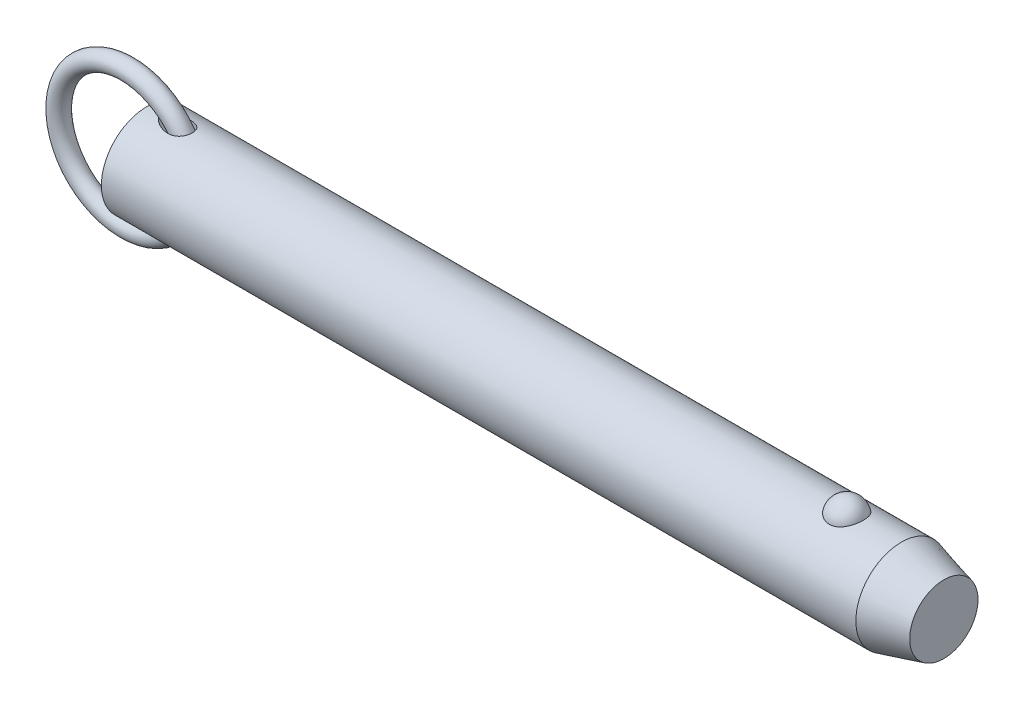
ISO-10303-21;
HEADER;
FILE_DESCRIPTION(('STEP AP214'),'2;1');
FILE_NAME('part.step','',(''),(''),'','','');
FILE_SCHEMA(('AUTOMOTIVE_DESIGN { 1 0 10303 214 1 1 1 1 }'));
ENDSEC;
DATA;
#1=APPLICATION_CONTEXT('core data for automotive mechanical design processes');
#2=APPLICATION_PROTOCOL_DEFINITION('international standard','automotive_design',2000,#1);
#3=PRODUCT_CONTEXT('',#1,'mechanical');
#4=PRODUCT('Part','Part','',(#3));
#5=PRODUCT_RELATED_PRODUCT_CATEGORY('part','',(#4));
#6=PRODUCT_DEFINITION_FORMATION('','',#4);
#7=PRODUCT_DEFINITION_CONTEXT('part definition',#1,'design');
#8=PRODUCT_DEFINITION('design','',#6,#7);
#9=PRODUCT_DEFINITION_SHAPE('','',#8);
#10=(LENGTH_UNIT() NAMED_UNIT(*) SI_UNIT(.MILLI.,.METRE.));
#11=(NAMED_UNIT(*) PLANE_ANGLE_UNIT() SI_UNIT($,.RADIAN.));
#12=(NAMED_UNIT(*) SI_UNIT($,.STERADIAN.) SOLID_ANGLE_UNIT());
#13=UNCERTAINTY_MEASURE_WITH_UNIT(LENGTH_MEASURE(1.E-05),#10,'distance_accuracy_value','');
#14=(GEOMETRIC_REPRESENTATION_CONTEXT(3) GLOBAL_UNCERTAINTY_ASSIGNED_CONTEXT((#13)) GLOBAL_UNIT_ASSIGNED_CONTEXT((#10,
#11,#12)) REPRESENTATION_CONTEXT('',''));
#15=CARTESIAN_POINT('',(0.,0.,0.));
#16=DIRECTION('',(0.,0.,1.));
#17=DIRECTION('',(1.,0.,0.));
#18=AXIS2_PLACEMENT_3D('',#15,#16,#17);
#19=CARTESIAN_POINT('',(-5.53898640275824,0.,0.));
#20=DIRECTION('',(0.,0.,1.));
#21=DIRECTION('',(1.,0.,0.));
#22=AXIS2_PLACEMENT_3D('',#19,#20,#21);
#23=TOROIDAL_SURFACE('',#22,19.05,2.54);
#24=CARTESIAN_POINT('',(16.0510135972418,0.,0.));
#25=VERTEX_POINT('',#24);
#26=VERTEX_LOOP('',#25);
#27=FACE_BOUND('',#26,.T.);
#28=ADVANCED_FACE('P0_F12',(#27),#23,.T.);
#29=CLOSED_SHELL('',(#28));
#30=MANIFOLD_SOLID_BREP('P0_B1',#29);
#31=CARTESIAN_POINT('',(0.,0.,0.));
#32=DIRECTION('',(1.,0.,0.));
#33=DIRECTION('',(0.,0.,-1.));
#34=AXIS2_PLACEMENT_3D('',#31,#32,#33);
#35=CYLINDRICAL_SURFACE('',#34,12.7);
#36=CARTESIAN_POINT('',(210.400738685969,0.,0.));
#37=DIRECTION('',(1.,0.,0.));
#38=DIRECTION('',(0.,0.,-1.));
#39=AXIS2_PLACEMENT_3D('',#36,#37,#38);
#40=CIRCLE('',#39,12.7);
#41=CARTESIAN_POINT('',(210.400738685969,0.,-12.7));
#42=VERTEX_POINT('',#41);
#43=EDGE_CURVE('P1_E89',#42,#42,#40,.T.);
#44=ORIENTED_EDGE('',*,*,#43,.F.);
#45=EDGE_LOOP('',(#44));
#46=FACE_BOUND('',#45,.T.);
#47=CARTESIAN_POINT('',(0.,0.,0.));
#48=DIRECTION('',(1.,0.,0.));
#49=DIRECTION('',(0.,0.,-1.));
#50=AXIS2_PLACEMENT_3D('',#47,#48,#49);
#51=CIRCLE('',#50,12.7);
#52=CARTESIAN_POINT('',(0.,0.,-12.7));
#53=VERTEX_POINT('',#52);
#54=EDGE_CURVE('P1_E52',#53,#53,#51,.T.);
#55=ORIENTED_EDGE('',*,*,#54,.T.);
#56=EDGE_LOOP('',(#55));
#57=FACE_BOUND('',#56,.T.);
#58=CARTESIAN_POINT('',(195.160042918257,11.7500437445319,4.81938502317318));
#59=CARTESIAN_POINT('',(195.035088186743,11.7500430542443,4.81938571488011));
#60=CARTESIAN_POINT('',(194.910144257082,11.7520975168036,4.81438658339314));
#61=CARTESIAN_POINT('',(194.661142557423,11.760253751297,4.79442904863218));
#62=CARTESIAN_POINT('',(194.537085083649,11.7663568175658,4.77946746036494));
#63=CARTESIAN_POINT('',(194.290901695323,11.7824262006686,4.7397141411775));
#64=CARTESIAN_POINT('',(194.168774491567,11.7923898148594,4.71492928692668));
#65=CARTESIAN_POINT('',(193.927187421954,11.8158938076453,4.65571340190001));
#66=CARTESIAN_POINT('',(193.80772859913,11.8294355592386,4.6212786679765));
#67=CARTESIAN_POINT('',(193.572557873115,11.8596812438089,4.54309502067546));
#68=CARTESIAN_POINT('',(193.456839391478,11.8763792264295,4.49936361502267));
#69=CARTESIAN_POINT('',(193.229653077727,11.9124878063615,4.40287235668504));
#70=CARTESIAN_POINT('',(193.118186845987,11.9318994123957,4.35010914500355));
#71=CARTESIAN_POINT('',(192.791278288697,11.9934256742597,4.17881316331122));
#72=CARTESIAN_POINT('',(192.583127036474,12.038858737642,4.04720756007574));
#73=CARTESIAN_POINT('',(192.185850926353,12.1352173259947,3.748564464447));
#74=CARTESIAN_POINT('',(191.997443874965,12.1862630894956,3.58061821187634));
#75=CARTESIAN_POINT('',(191.650521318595,12.2875163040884,3.21600758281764));
#76=CARTESIAN_POINT('',(191.492011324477,12.3377235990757,3.0193379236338));
#77=CARTESIAN_POINT('',(191.20168878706,12.4344923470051,2.592916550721));
#78=CARTESIAN_POINT('',(191.071376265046,12.4807925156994,2.36208286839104));
#79=CARTESIAN_POINT('',(190.849407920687,12.5623454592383,1.88070399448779));
#80=CARTESIAN_POINT('',(190.757755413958,12.5975972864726,1.63015711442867));
#81=CARTESIAN_POINT('',(190.614046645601,12.6538414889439,1.1129886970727));
#82=CARTESIAN_POINT('',(190.562499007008,12.6746503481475,0.846205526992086));
#83=CARTESIAN_POINT('',(190.501977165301,12.699153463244,0.307085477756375));
#84=CARTESIAN_POINT('',(190.493001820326,12.7028481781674,0.0347487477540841));
#85=CARTESIAN_POINT('',(190.517731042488,12.6927785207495,-0.506073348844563));
#86=CARTESIAN_POINT('',(190.551189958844,12.6791146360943,-0.774571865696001));
#87=CARTESIAN_POINT('',(190.659687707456,12.635882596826,-1.30170246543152));
#88=CARTESIAN_POINT('',(190.73472729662,12.606314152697,-1.56033436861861));
#89=CARTESIAN_POINT('',(190.92500006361,12.5342328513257,-2.0608389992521));
#90=CARTESIAN_POINT('',(191.040287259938,12.4917026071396,-2.30268867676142));
#91=CARTESIAN_POINT('',(191.308704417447,12.3981123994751,-2.76259600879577));
#92=CARTESIAN_POINT('',(191.461837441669,12.3470517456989,-2.98065173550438));
#93=CARTESIAN_POINT('',(191.803507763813,12.2416045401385,-3.38786328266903));
#94=CARTESIAN_POINT('',(191.992201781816,12.1872040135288,-3.57688418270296));
#95=CARTESIAN_POINT('',(192.400239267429,12.0814086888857,-3.91941073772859));
#96=CARTESIAN_POINT('',(192.619580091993,12.0300136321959,-4.07291945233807));
#97=CARTESIAN_POINT('',(193.078375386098,11.9373542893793,-4.33691289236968));
#98=CARTESIAN_POINT('',(193.317304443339,11.8958982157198,-4.44824125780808));
#99=CARTESIAN_POINT('',(193.81243761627,11.8268116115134,-4.62881985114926));
#100=CARTESIAN_POINT('',(194.068635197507,11.7991758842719,-4.69808589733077));
#101=CARTESIAN_POINT('',(194.577164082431,11.7622209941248,-4.78983181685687));
#102=CARTESIAN_POINT('',(194.829041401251,11.7520502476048,-4.81449025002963));
#103=CARTESIAN_POINT('',(195.333573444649,11.7485796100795,-4.82295735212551));
#104=CARTESIAN_POINT('',(195.586228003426,11.7552763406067,-4.80677420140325));
#105=CARTESIAN_POINT('',(196.076834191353,11.7842584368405,-4.73525430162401));
#106=CARTESIAN_POINT('',(196.314998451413,11.8060486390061,-4.68116061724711));
#107=CARTESIAN_POINT('',(196.778489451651,11.8622750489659,-4.53678133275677));
#108=CARTESIAN_POINT('',(197.003815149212,11.8967122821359,-4.44649279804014));
#109=CARTESIAN_POINT('',(197.440801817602,11.9754603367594,-4.2298761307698));
#110=CARTESIAN_POINT('',(197.652057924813,12.0199699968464,-4.10280539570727));
#111=CARTESIAN_POINT('',(198.050601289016,12.1138028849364,-3.81685409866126));
#112=CARTESIAN_POINT('',(198.237883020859,12.163127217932,-3.65796622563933));
#113=CARTESIAN_POINT('',(198.593350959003,12.2642343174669,-3.30364864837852));
#114=CARTESIAN_POINT('',(198.760111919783,12.3160165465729,-3.10678783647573));
#115=CARTESIAN_POINT('',(199.059579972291,12.4142566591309,-2.68748409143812));
#116=CARTESIAN_POINT('',(199.192280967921,12.4607135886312,-2.4650365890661));
#117=CARTESIAN_POINT('',(199.424691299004,12.5450236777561,-1.9928951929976));
#118=CARTESIAN_POINT('',(199.523215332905,12.5825557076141,-1.74255918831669));
#119=CARTESIAN_POINT('',(199.679227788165,12.6431720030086,-1.2277373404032));
#120=CARTESIAN_POINT('',(199.736715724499,12.6662560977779,-0.96325132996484));
#121=CARTESIAN_POINT('',(199.809544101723,12.6956486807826,-0.4273550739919));
#122=CARTESIAN_POINT('',(199.824837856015,12.7019385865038,-0.155937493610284));
#123=CARTESIAN_POINT('',(199.812779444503,12.6970201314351,0.385928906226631));
#124=CARTESIAN_POINT('',(199.78542805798,12.6858120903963,0.656377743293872));
#125=CARTESIAN_POINT('',(199.713060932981,12.6568455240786,1.05454017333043));
#126=CARTESIAN_POINT('',(199.683796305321,12.6451962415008,1.185778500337));
#127=CARTESIAN_POINT('',(199.615022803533,12.6181819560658,1.44513808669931));
#128=CARTESIAN_POINT('',(199.575517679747,12.6028183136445,1.57326046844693));
#129=CARTESIAN_POINT('',(199.486439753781,12.5687547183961,1.82554978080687));
#130=CARTESIAN_POINT('',(199.436862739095,12.5500533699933,1.9497150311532));
#131=CARTESIAN_POINT('',(199.32792115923,12.5098093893,2.19314370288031));
#132=CARTESIAN_POINT('',(199.268560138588,12.4882677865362,2.31240887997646));
#133=CARTESIAN_POINT('',(199.13997128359,12.4427679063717,2.5459303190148));
#134=CARTESIAN_POINT('',(199.070688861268,12.4187964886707,2.66015396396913));
#135=CARTESIAN_POINT('',(198.922903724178,12.3691892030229,2.88202659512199));
#136=CARTESIAN_POINT('',(198.844404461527,12.3435539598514,2.98967802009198));
#137=CARTESIAN_POINT('',(198.678550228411,12.2912955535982,3.1977438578));
#138=CARTESIAN_POINT('',(198.591191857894,12.2646720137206,3.29815546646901));
#139=CARTESIAN_POINT('',(198.408161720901,12.2111945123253,3.49095035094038));
#140=CARTESIAN_POINT('',(198.312493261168,12.1843406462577,3.58333679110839));
#141=CARTESIAN_POINT('',(198.113627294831,12.1312249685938,3.75922876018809));
#142=CARTESIAN_POINT('',(198.010450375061,12.104961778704,3.84275713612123));
#143=CARTESIAN_POINT('',(197.79701336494,12.0537284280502,4.00056406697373));
#144=CARTESIAN_POINT('',(197.686756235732,12.028757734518,4.07484645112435));
#145=CARTESIAN_POINT('',(197.459755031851,11.9808306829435,4.21367959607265));
#146=CARTESIAN_POINT('',(197.343006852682,11.9578756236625,4.27822410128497));
#147=CARTESIAN_POINT('',(197.10394258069,11.9147184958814,4.39698483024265));
#148=CARTESIAN_POINT('',(196.981628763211,11.894515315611,4.45120522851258));
#149=CARTESIAN_POINT('',(196.722952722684,11.8561129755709,4.55255353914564));
#150=CARTESIAN_POINT('',(196.586223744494,11.8381764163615,4.59884858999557));
#151=CARTESIAN_POINT('',(196.308608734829,11.8069093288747,4.67853897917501));
#152=CARTESIAN_POINT('',(196.167724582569,11.7935767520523,4.71194005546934));
#153=CARTESIAN_POINT('',(195.88309446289,11.7720277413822,4.76552188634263));
#154=CARTESIAN_POINT('',(195.739348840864,11.7638106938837,4.78570422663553));
#155=CARTESIAN_POINT('',(195.450411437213,11.7528195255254,4.81263433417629));
#156=CARTESIAN_POINT('',(195.305219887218,11.7500445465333,4.81938421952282));
#157=CARTESIAN_POINT('',(195.160042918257,11.7500437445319,4.81938502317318));
#158=B_SPLINE_CURVE_WITH_KNOTS('',3,(#58,#59,#60,#61,#62,#63,#64,#65,#66,#67,#68,#69,#70,#71,
#72,#73,#74,#75,#76,#77,#78,#79,#80,#81,#82,#83,#84,#85,#86,#87,#88,#89,#90,#91,#92,#93,#94,#95,
#96,#97,#98,#99,#100,#101,#102,#103,#104,#105,#106,#107,#108,#109,#110,#111,#112,#113,#114,#115,
#116,#117,#118,#119,#120,#121,#122,#123,#124,#125,#126,#127,#128,#129,#130,#131,#132,#133,#134,
#135,#136,#137,#138,#139,#140,#141,#142,#143,#144,#145,#146,#147,#148,#149,#150,#151,#152,#153,
#154,#155,#156,#157),.UNSPECIFIED.,.T.,.F.,(4,2,2,2,2,2,2,2,2,2,2,2,2,2,2,2,2,2,2,2,2,2,2,2,2,2,
2,2,2,2,2,2,2,2,2,2,2,2,2,2,2,2,2,2,2,2,2,2,2,4),(0.,0.374729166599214,0.749578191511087,
1.12416526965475,1.49889629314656,1.87292776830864,2.24709865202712,2.99481328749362,
3.76399449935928,4.53331735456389,5.3368391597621,6.14042986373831,6.95405296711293,
7.76765424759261,8.57656703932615,9.38549455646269,10.1955119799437,11.0055949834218,
11.8193353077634,12.6330054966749,13.4294141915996,14.2255231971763,14.9815786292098,
15.7374826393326,16.4696948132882,17.2019663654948,17.9501979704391,18.6986017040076,
19.4844704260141,20.2704797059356,21.0815215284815,21.8925729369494,22.7045213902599,
23.5164550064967,23.9209608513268,24.3253187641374,24.7298461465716,25.1342272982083,
25.54092555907,25.9474719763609,26.3541750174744,26.7607169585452,27.1661834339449,
27.5714814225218,27.9770386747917,28.3824315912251,28.818120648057,29.2536155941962,
29.6890582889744,30.1244323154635),.UNSPECIFIED.);
#159=CARTESIAN_POINT('',(195.160042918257,11.7500437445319,4.81938502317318));
#160=VERTEX_POINT('',#159);
#161=EDGE_CURVE('P1_E80',#160,#160,#158,.T.);
#162=ORIENTED_EDGE('',*,*,#161,.T.);
#163=EDGE_LOOP('',(#162));
#164=FACE_BOUND('',#163,.T.);
#165=CARTESIAN_POINT('',(-5.53898640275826,0.,0.));
#166=DIRECTION('',(0.796400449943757,-0.604769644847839,0.));
#167=DIRECTION('',(0.604769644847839,0.796400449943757,0.));
#168=AXIS2_PLACEMENT_3D('',#165,#166,#167);
#169=ELLIPSE('',#168,15.9467514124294,12.7);
#170=CARTESIAN_POINT('',(4.09482149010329,12.6864319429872,0.586893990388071));
#171=VERTEX_POINT('',#170);
#172=CARTESIAN_POINT('',(4.09482149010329,12.6864319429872,-0.586893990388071));
#173=VERTEX_POINT('',#172);
#174=EDGE_CURVE('P1_E47',#171,#173,#169,.F.);
#175=ORIENTED_EDGE('',*,*,#174,.T.);
#176=CARTESIAN_POINT('',(4.06153170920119,12.6905758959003,-0.48916605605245));
#177=CARTESIAN_POINT('',(4.0811137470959,12.6881366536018,-0.552489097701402));
#178=CARTESIAN_POINT('',(4.1041785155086,12.6852663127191,-0.614604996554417));
#179=CARTESIAN_POINT('',(4.15628434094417,12.6787965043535,-0.736067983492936));
#180=CARTESIAN_POINT('',(4.18531032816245,12.6751988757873,-0.795421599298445));
#181=CARTESIAN_POINT('',(4.27911159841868,12.6636052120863,-0.967590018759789));
#182=CARTESIAN_POINT('',(4.35123408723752,12.654730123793,-1.07635920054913));
#183=CARTESIAN_POINT('',(4.49106800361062,12.6376715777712,-1.25922957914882));
#184=CARTESIAN_POINT('',(4.55601066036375,12.6297947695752,-1.33556751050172));
#185=CARTESIAN_POINT('',(4.692236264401,12.6134116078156,-1.4823274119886));
#186=CARTESIAN_POINT('',(4.76352147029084,12.6049050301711,-1.55274725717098));
#187=CARTESIAN_POINT('',(4.91163946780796,12.587417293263,-1.68868704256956));
#188=CARTESIAN_POINT('',(4.98851399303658,12.5784327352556,-1.75416062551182));
#189=CARTESIAN_POINT('',(5.14630057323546,12.560235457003,-1.88003275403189));
#190=CARTESIAN_POINT('',(5.22721398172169,12.5510226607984,-1.94042957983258));
#191=CARTESIAN_POINT('',(5.45368877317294,12.5256514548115,-2.09966332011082));
#192=CARTESIAN_POINT('',(5.60261616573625,12.5094182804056,-2.19371988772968));
#193=CARTESIAN_POINT('',(5.90795545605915,12.4774211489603,-2.36893890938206));
#194=CARTESIAN_POINT('',(6.0643723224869,12.4616575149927,-2.45009264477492));
#195=CARTESIAN_POINT('',(6.38306132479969,12.431227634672,-2.6000824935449));
#196=CARTESIAN_POINT('',(6.54533237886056,12.4165611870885,-2.66892086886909));
#197=CARTESIAN_POINT('',(6.87462618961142,12.3889351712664,-2.79435199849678));
#198=CARTESIAN_POINT('',(7.04164773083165,12.3759751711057,-2.85094785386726));
#199=CARTESIAN_POINT('',(7.38726647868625,12.3518460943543,-2.95377962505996));
#200=CARTESIAN_POINT('',(7.56604577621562,12.3407843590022,-2.99943209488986));
#201=CARTESIAN_POINT('',(7.92698692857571,12.3219309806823,-3.07596683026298));
#202=CARTESIAN_POINT('',(8.10914972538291,12.314140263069,-3.10684491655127));
#203=CARTESIAN_POINT('',(8.47511457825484,12.3025918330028,-3.15226850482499));
#204=CARTESIAN_POINT('',(8.6589097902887,12.2988216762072,-3.16686440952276));
#205=CARTESIAN_POINT('',(9.02696087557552,12.2959421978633,-3.17802250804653));
#206=CARTESIAN_POINT('',(9.21121628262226,12.2968292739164,-3.17459864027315));
#207=CARTESIAN_POINT('',(9.61636263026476,12.3045198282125,-3.14471110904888));
#208=CARTESIAN_POINT('',(9.83695552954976,12.3125080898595,-3.11363232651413));
#209=CARTESIAN_POINT('',(10.1619126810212,12.3303028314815,-3.04206574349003));
#210=CARTESIAN_POINT('',(10.2692747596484,12.3372061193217,-3.01403983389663));
#211=CARTESIAN_POINT('',(10.4811758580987,12.3528538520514,-2.94925947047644));
#212=CARTESIAN_POINT('',(10.5857162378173,12.361597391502,-2.91250930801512));
#213=CARTESIAN_POINT('',(10.792132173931,12.3808585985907,-2.8295174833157));
#214=CARTESIAN_POINT('',(10.8939665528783,12.3913944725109,-2.78317723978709));
#215=CARTESIAN_POINT('',(11.092611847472,12.4138762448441,-2.68112002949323));
#216=CARTESIAN_POINT('',(11.1894254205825,12.4258213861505,-2.62540809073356));
#217=CARTESIAN_POINT('',(11.3768740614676,12.4507225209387,-2.50465655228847));
#218=CARTESIAN_POINT('',(11.4675115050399,12.4636781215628,-2.43962056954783));
#219=CARTESIAN_POINT('',(11.6414572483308,12.4901070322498,-2.30048560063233));
#220=CARTESIAN_POINT('',(11.7247669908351,12.5035802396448,-2.22638840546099));
#221=CARTESIAN_POINT('',(11.8713131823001,12.5285000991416,-2.08117367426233));
#222=CARTESIAN_POINT('',(11.9357009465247,12.5399538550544,-2.01121596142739));
#223=CARTESIAN_POINT('',(12.0576805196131,12.5624496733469,-1.86555293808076));
#224=CARTESIAN_POINT('',(12.1152732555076,12.5734917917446,-1.7898484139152));
#225=CARTESIAN_POINT('',(12.223073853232,12.5947858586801,-1.63327883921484));
#226=CARTESIAN_POINT('',(12.2732844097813,12.6050380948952,-1.5524156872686));
#227=CARTESIAN_POINT('',(12.3658430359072,12.6243983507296,-1.38621267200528));
#228=CARTESIAN_POINT('',(12.408191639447,12.6335064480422,-1.30087311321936));
#229=CARTESIAN_POINT('',(12.5150098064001,12.6569076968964,-1.05702619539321));
#230=CARTESIAN_POINT('',(12.5703399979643,12.6695746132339,-0.894232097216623));
#231=CARTESIAN_POINT('',(12.6526225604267,12.6886816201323,-0.561391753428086));
#232=CARTESIAN_POINT('',(12.6795825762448,12.6951233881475,-0.391347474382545));
#233=CARTESIAN_POINT('',(12.7041016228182,12.7009766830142,-0.0537636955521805));
#234=CARTESIAN_POINT('',(12.7024538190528,12.7005778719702,0.113714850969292));
#235=CARTESIAN_POINT('',(12.6717240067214,12.6932548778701,0.445979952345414));
#236=CARTESIAN_POINT('',(12.6426435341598,12.6863310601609,0.610766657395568));
#237=CARTESIAN_POINT('',(12.5579769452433,12.6667465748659,0.932429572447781));
#238=CARTESIAN_POINT('',(12.5024793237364,12.6541050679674,1.08933027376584));
#239=CARTESIAN_POINT('',(12.3665691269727,12.6244558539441,1.39146752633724));
#240=CARTESIAN_POINT('',(12.2861577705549,12.6074483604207,1.53670464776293));
#241=CARTESIAN_POINT('',(12.1018203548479,12.5706804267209,1.81319588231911));
#242=CARTESIAN_POINT('',(11.9976588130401,12.5508932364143,1.94428915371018));
#243=CARTESIAN_POINT('',(11.7695265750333,12.5107540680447,2.18776051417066));
#244=CARTESIAN_POINT('',(11.6455540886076,12.4904020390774,2.3001369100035));
#245=CARTESIAN_POINT('',(11.3759347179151,12.4502278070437,2.50870972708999));
#246=CARTESIAN_POINT('',(11.2295880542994,12.4304654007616,2.60400962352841));
#247=CARTESIAN_POINT('',(10.9239803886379,12.3941696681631,2.77162929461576));
#248=CARTESIAN_POINT('',(10.7647152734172,12.3776373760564,2.84394171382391));
#249=CARTESIAN_POINT('',(10.4192039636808,12.3473062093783,2.97303525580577));
#250=CARTESIAN_POINT('',(10.2319332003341,12.3340204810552,3.027171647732));
#251=CARTESIAN_POINT('',(9.85152982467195,12.3134301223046,3.10986173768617));
#252=CARTESIAN_POINT('',(9.65839336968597,12.3061295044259,3.13839827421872));
#253=CARTESIAN_POINT('',(9.31022514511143,12.2982822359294,3.16897517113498));
#254=CARTESIAN_POINT('',(9.15555718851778,12.2966525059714,3.17526894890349));
#255=CARTESIAN_POINT('',(8.84618945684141,12.2967963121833,3.17471335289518));
#256=CARTESIAN_POINT('',(8.6914897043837,12.2985715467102,3.16785742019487));
#257=CARTESIAN_POINT('',(8.38280471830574,12.3051648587,3.14214692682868));
#258=CARTESIAN_POINT('',(8.22882218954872,12.3099904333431,3.12326280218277));
#259=CARTESIAN_POINT('',(7.92276070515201,12.3222644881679,3.07448013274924));
#260=CARTESIAN_POINT('',(7.77068148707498,12.3297126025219,3.04458312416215));
#261=CARTESIAN_POINT('',(7.46452663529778,12.3470493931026,2.97350781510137));
#262=CARTESIAN_POINT('',(7.31052714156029,12.3570043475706,2.93201910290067));
#263=CARTESIAN_POINT('',(7.00579083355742,12.3787609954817,2.83876185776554));
#264=CARTESIAN_POINT('',(6.85505451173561,12.3905629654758,2.7869917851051));
#265=CARTESIAN_POINT('',(6.55781208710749,12.415528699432,2.67357744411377));
#266=CARTESIAN_POINT('',(6.41129783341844,12.4286895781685,2.61195394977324));
#267=CARTESIAN_POINT('',(6.12302950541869,12.4559398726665,2.47874512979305));
#268=CARTESIAN_POINT('',(5.98127390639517,12.4700289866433,2.40716303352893));
#269=CARTESIAN_POINT('',(5.67073126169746,12.5020754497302,2.23550426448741));
#270=CARTESIAN_POINT('',(5.50343839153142,12.5201625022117,2.13268685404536));
#271=CARTESIAN_POINT('',(5.26147616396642,12.5471537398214,1.96522579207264));
#272=CARTESIAN_POINT('',(5.18224299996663,12.5561365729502,1.90713440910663));
#273=CARTESIAN_POINT('',(5.0274647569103,12.5739122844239,1.78618989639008));
#274=CARTESIAN_POINT('',(4.95191912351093,12.5827051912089,1.72333748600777));
#275=CARTESIAN_POINT('',(4.81787163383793,12.598469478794,1.60360864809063));
#276=CARTESIAN_POINT('',(4.75865966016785,12.6054958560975,1.54753994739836));
#277=CARTESIAN_POINT('',(4.64406285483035,12.6191906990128,1.43158546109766));
#278=CARTESIAN_POINT('',(4.58867926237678,12.6258590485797,1.37169845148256));
#279=CARTESIAN_POINT('',(4.43014912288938,12.6450546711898,1.18656670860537));
#280=CARTESIAN_POINT('',(4.33372726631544,12.6568788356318,1.05507993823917));
#281=CARTESIAN_POINT('',(4.21252055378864,12.6718304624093,0.848052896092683));
#282=CARTESIAN_POINT('',(4.17660155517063,12.6762773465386,0.779100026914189));
#283=CARTESIAN_POINT('',(4.11264979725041,12.6842122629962,0.637080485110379));
#284=CARTESIAN_POINT('',(4.08466792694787,12.6876941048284,0.563990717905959));
#285=CARTESIAN_POINT('',(4.06153170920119,12.6905758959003,0.489166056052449));
#286=B_SPLINE_CURVE_WITH_KNOTS('',3,(#176,#177,#178,#179,#180,#181,#182,#183,#184,#185,#186,
#187,#188,#189,#190,#191,#192,#193,#194,#195,#196,#197,#198,#199,#200,#201,#202,#203,#204,#205,
#206,#207,#208,#209,#210,#211,#212,#213,#214,#215,#216,#217,#218,#219,#220,#221,#222,#223,#224,
#225,#226,#227,#228,#229,#230,#231,#232,#233,#234,#235,#236,#237,#238,#239,#240,#241,#242,#243,
#244,#245,#246,#247,#248,#249,#250,#251,#252,#253,#254,#255,#256,#257,#258,#259,#260,#261,#262,
#263,#264,#265,#266,#267,#268,#269,#270,#271,#272,#273,#274,#275,#276,#277,#278,#279,#280,#281,
#282,#283,#284,#285),.UNSPECIFIED.,.F.,.F.,(4,2,2,2,2,2,2,2,2,2,2,2,2,2,2,2,2,2,2,2,2,2,2,2,2,2,
2,2,2,2,2,2,2,2,2,2,2,2,2,2,2,2,2,2,2,2,2,2,2,2,2,2,2,2,4),(0.,0.198708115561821,
0.39691995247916,0.787580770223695,1.08882492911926,1.3901767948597,1.69407136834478,
1.9980684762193,2.52793143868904,3.05815092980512,3.58827293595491,4.1182605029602,
4.67218806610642,5.22627222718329,5.77863637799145,6.33057333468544,6.99657211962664,
7.32977411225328,7.66281254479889,7.99946156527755,8.33593054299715,8.6722693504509,
9.00854178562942,9.29544181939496,9.58230266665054,9.8690585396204,10.155794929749,
10.670233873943,11.184534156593,11.6845985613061,12.1846349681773,12.6830079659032,
13.1813565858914,13.6848795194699,14.1884479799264,14.7135333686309,15.2387866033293,
15.8228373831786,16.4072794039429,16.8710810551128,17.3351141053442,17.8002921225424,
18.2654052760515,18.7444169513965,19.2235004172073,19.7015868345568,20.1795185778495,
20.7699825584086,21.0658110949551,21.361595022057,21.6069574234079,21.8523988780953,
22.3397467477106,22.5729183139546,22.8075527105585),.UNSPECIFIED.);
#287=EDGE_CURVE('P1_E51',#173,#171,#286,.T.);
#288=ORIENTED_EDGE('',*,*,#287,.T.);
#289=EDGE_LOOP('',(#175,#288));
#290=FACE_BOUND('',#289,.T.);
#291=CARTESIAN_POINT('',(-5.53898640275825,0.,0.));
#292=DIRECTION('',(-0.796400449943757,-0.604769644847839,0.));
#293=DIRECTION('',(0.604769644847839,-0.796400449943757,0.));
#294=AXIS2_PLACEMENT_3D('',#291,#292,#293);
#295=ELLIPSE('',#294,15.9467514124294,12.7);
#296=CARTESIAN_POINT('',(4.0948214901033,-12.6864319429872,0.586893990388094));
#297=VERTEX_POINT('',#296);
#298=CARTESIAN_POINT('',(4.0948214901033,-12.6864319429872,-0.586893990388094));
#299=VERTEX_POINT('',#298);
#300=EDGE_CURVE('P1_E28',#297,#299,#295,.F.);
#301=ORIENTED_EDGE('',*,*,#300,.F.);
#302=CARTESIAN_POINT('',(4.06153170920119,-12.6905758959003,0.489166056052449));
#303=CARTESIAN_POINT('',(4.08111374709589,-12.6881366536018,0.552489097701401));
#304=CARTESIAN_POINT('',(4.1041785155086,-12.6852663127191,0.614604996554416));
#305=CARTESIAN_POINT('',(4.15628434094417,-12.6787965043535,0.736067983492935));
#306=CARTESIAN_POINT('',(4.18531032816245,-12.6751988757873,0.795421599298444));
#307=CARTESIAN_POINT('',(4.27911159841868,-12.6636052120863,0.967590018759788));
#308=CARTESIAN_POINT('',(4.35123408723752,-12.654730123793,1.07635920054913));
#309=CARTESIAN_POINT('',(4.49106800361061,-12.6376715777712,1.25922957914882));
#310=CARTESIAN_POINT('',(4.55601066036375,-12.6297947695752,1.33556751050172));
#311=CARTESIAN_POINT('',(4.692236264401,-12.6134116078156,1.48232741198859));
#312=CARTESIAN_POINT('',(4.76352147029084,-12.6049050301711,1.55274725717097));
#313=CARTESIAN_POINT('',(4.91163946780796,-12.587417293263,1.68868704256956));
#314=CARTESIAN_POINT('',(4.98851399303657,-12.5784327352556,1.75416062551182));
#315=CARTESIAN_POINT('',(5.14630057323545,-12.560235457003,1.88003275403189));
#316=CARTESIAN_POINT('',(5.22721398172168,-12.5510226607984,1.94042957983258));
#317=CARTESIAN_POINT('',(5.45368877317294,-12.5256514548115,2.09966332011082));
#318=CARTESIAN_POINT('',(5.60261616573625,-12.5094182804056,2.19371988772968));
#319=CARTESIAN_POINT('',(5.90795545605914,-12.4774211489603,2.36893890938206));
#320=CARTESIAN_POINT('',(6.06437232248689,-12.4616575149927,2.45009264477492));
#321=CARTESIAN_POINT('',(6.38306132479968,-12.431227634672,2.6000824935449));
#322=CARTESIAN_POINT('',(6.54533237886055,-12.4165611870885,2.66892086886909));
#323=CARTESIAN_POINT('',(6.87462618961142,-12.3889351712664,2.79435199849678));
#324=CARTESIAN_POINT('',(7.04164773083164,-12.3759751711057,2.85094785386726));
#325=CARTESIAN_POINT('',(7.38726647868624,-12.3518460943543,2.95377962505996));
#326=CARTESIAN_POINT('',(7.56604577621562,-12.3407843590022,2.99943209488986));
#327=CARTESIAN_POINT('',(7.92698692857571,-12.3219309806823,3.07596683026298));
#328=CARTESIAN_POINT('',(8.1091497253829,-12.314140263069,3.10684491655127));
#329=CARTESIAN_POINT('',(8.47511457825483,-12.3025918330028,3.15226850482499));
#330=CARTESIAN_POINT('',(8.65890979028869,-12.2988216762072,3.16686440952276));
#331=CARTESIAN_POINT('',(9.02696087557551,-12.2959421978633,3.17802250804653));
#332=CARTESIAN_POINT('',(9.21121628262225,-12.2968292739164,3.17459864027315));
#333=CARTESIAN_POINT('',(9.61636263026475,-12.3045198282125,3.14471110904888));
#334=CARTESIAN_POINT('',(9.83695552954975,-12.3125080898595,3.11363232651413));
#335=CARTESIAN_POINT('',(10.1619126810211,-12.3303028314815,3.04206574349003));
#336=CARTESIAN_POINT('',(10.2692747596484,-12.3372061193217,3.01403983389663));
#337=CARTESIAN_POINT('',(10.4811758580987,-12.3528538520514,2.94925947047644));
#338=CARTESIAN_POINT('',(10.5857162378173,-12.361597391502,2.91250930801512));
#339=CARTESIAN_POINT('',(10.792132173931,-12.3808585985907,2.8295174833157));
#340=CARTESIAN_POINT('',(10.8939665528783,-12.3913944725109,2.78317723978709));
#341=CARTESIAN_POINT('',(11.092611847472,-12.4138762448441,2.68112002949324));
#342=CARTESIAN_POINT('',(11.1894254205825,-12.4258213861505,2.62540809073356));
#343=CARTESIAN_POINT('',(11.3768740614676,-12.4507225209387,2.50465655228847));
#344=CARTESIAN_POINT('',(11.4675115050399,-12.4636781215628,2.43962056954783));
#345=CARTESIAN_POINT('',(11.6414572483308,-12.4901070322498,2.30048560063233));
#346=CARTESIAN_POINT('',(11.7247669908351,-12.5035802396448,2.22638840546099));
#347=CARTESIAN_POINT('',(11.8713131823,-12.5285000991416,2.08117367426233));
#348=CARTESIAN_POINT('',(11.9357009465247,-12.5399538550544,2.01121596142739));
#349=CARTESIAN_POINT('',(12.0576805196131,-12.5624496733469,1.86555293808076));
#350=CARTESIAN_POINT('',(12.1152732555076,-12.5734917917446,1.7898484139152));
#351=CARTESIAN_POINT('',(12.223073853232,-12.5947858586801,1.63327883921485));
#352=CARTESIAN_POINT('',(12.2732844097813,-12.6050380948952,1.5524156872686));
#353=CARTESIAN_POINT('',(12.3658430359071,-12.6243983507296,1.38621267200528));
#354=CARTESIAN_POINT('',(12.408191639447,-12.6335064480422,1.30087311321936));
#355=CARTESIAN_POINT('',(12.5150098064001,-12.6569076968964,1.05702619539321));
#356=CARTESIAN_POINT('',(12.5703399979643,-12.6695746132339,0.894232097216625));
#357=CARTESIAN_POINT('',(12.6526225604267,-12.6886816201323,0.56139175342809));
#358=CARTESIAN_POINT('',(12.6795825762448,-12.6951233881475,0.39134747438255));
#359=CARTESIAN_POINT('',(12.7041016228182,-12.7009766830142,0.0537636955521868));
#360=CARTESIAN_POINT('',(12.7024538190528,-12.7005778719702,-0.113714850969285));
#361=CARTESIAN_POINT('',(12.6717240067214,-12.6932548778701,-0.445979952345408));
#362=CARTESIAN_POINT('',(12.6426435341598,-12.6863310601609,-0.610766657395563));
#363=CARTESIAN_POINT('',(12.5579769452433,-12.6667465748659,-0.932429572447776));
#364=CARTESIAN_POINT('',(12.5024793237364,-12.6541050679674,-1.08933027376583));
#365=CARTESIAN_POINT('',(12.3665691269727,-12.6244558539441,-1.39146752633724));
#366=CARTESIAN_POINT('',(12.2861577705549,-12.6074483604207,-1.53670464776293));
#367=CARTESIAN_POINT('',(12.1018203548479,-12.5706804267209,-1.81319588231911));
#368=CARTESIAN_POINT('',(11.9976588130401,-12.5508932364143,-1.94428915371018));
#369=CARTESIAN_POINT('',(11.7695265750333,-12.5107540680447,-2.18776051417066));
#370=CARTESIAN_POINT('',(11.6455540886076,-12.4904020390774,-2.3001369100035));
#371=CARTESIAN_POINT('',(11.3759347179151,-12.4502278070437,-2.50870972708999));
#372=CARTESIAN_POINT('',(11.2295880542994,-12.4304654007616,-2.60400962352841));
#373=CARTESIAN_POINT('',(10.9239803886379,-12.3941696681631,-2.77162929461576));
#374=CARTESIAN_POINT('',(10.7647152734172,-12.3776373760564,-2.84394171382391));
#375=CARTESIAN_POINT('',(10.4192039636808,-12.3473062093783,-2.97303525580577));
#376=CARTESIAN_POINT('',(10.2319332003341,-12.3340204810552,-3.027171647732));
#377=CARTESIAN_POINT('',(9.85152982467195,-12.3134301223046,-3.10986173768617));
#378=CARTESIAN_POINT('',(9.65839336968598,-12.3061295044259,-3.13839827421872));
#379=CARTESIAN_POINT('',(9.31022514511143,-12.2982822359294,-3.16897517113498));
#380=CARTESIAN_POINT('',(9.15555718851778,-12.2966525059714,-3.17526894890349));
#381=CARTESIAN_POINT('',(8.84618945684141,-12.2967963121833,-3.17471335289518));
#382=CARTESIAN_POINT('',(8.6914897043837,-12.2985715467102,-3.16785742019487));
#383=CARTESIAN_POINT('',(8.38280471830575,-12.3051648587,-3.14214692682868));
#384=CARTESIAN_POINT('',(8.22882218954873,-12.3099904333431,-3.12326280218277));
#385=CARTESIAN_POINT('',(7.92276070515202,-12.3222644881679,-3.07448013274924));
#386=CARTESIAN_POINT('',(7.77068148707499,-12.3297126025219,-3.04458312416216));
#387=CARTESIAN_POINT('',(7.46452663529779,-12.3470493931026,-2.97350781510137));
#388=CARTESIAN_POINT('',(7.3105271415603,-12.3570043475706,-2.93201910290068));
#389=CARTESIAN_POINT('',(7.00579083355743,-12.3787609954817,-2.83876185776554));
#390=CARTESIAN_POINT('',(6.85505451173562,-12.3905629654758,-2.78699178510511));
#391=CARTESIAN_POINT('',(6.5578120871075,-12.415528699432,-2.67357744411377));
#392=CARTESIAN_POINT('',(6.41129783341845,-12.4286895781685,-2.61195394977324));
#393=CARTESIAN_POINT('',(6.12302950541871,-12.4559398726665,-2.47874512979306));
#394=CARTESIAN_POINT('',(5.98127390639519,-12.4700289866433,-2.40716303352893));
#395=CARTESIAN_POINT('',(5.67073126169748,-12.5020754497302,-2.23550426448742));
#396=CARTESIAN_POINT('',(5.50343839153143,-12.5201625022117,-2.13268685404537));
#397=CARTESIAN_POINT('',(5.26147616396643,-12.5471537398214,-1.96522579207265));
#398=CARTESIAN_POINT('',(5.18224299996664,-12.5561365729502,-1.90713440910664));
#399=CARTESIAN_POINT('',(5.02746475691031,-12.5739122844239,-1.78618989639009));
#400=CARTESIAN_POINT('',(4.95191912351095,-12.5827051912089,-1.72333748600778));
#401=CARTESIAN_POINT('',(4.81787163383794,-12.598469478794,-1.60360864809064));
#402=CARTESIAN_POINT('',(4.75865966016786,-12.6054958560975,-1.54753994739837));
#403=CARTESIAN_POINT('',(4.64406285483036,-12.6191906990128,-1.43158546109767));
#404=CARTESIAN_POINT('',(4.58867926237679,-12.6258590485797,-1.37169845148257));
#405=CARTESIAN_POINT('',(4.43014912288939,-12.6450546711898,-1.18656670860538));
#406=CARTESIAN_POINT('',(4.33372726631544,-12.6568788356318,-1.05507993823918));
#407=CARTESIAN_POINT('',(4.21252055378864,-12.6718304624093,-0.848052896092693));
#408=CARTESIAN_POINT('',(4.17660155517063,-12.6762773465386,-0.779100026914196));
#409=CARTESIAN_POINT('',(4.11264979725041,-12.6842122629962,-0.637080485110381));
#410=CARTESIAN_POINT('',(4.08466792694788,-12.6876941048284,-0.563990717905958));
#411=CARTESIAN_POINT('',(4.0615317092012,-12.6905758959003,-0.489166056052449));
#412=B_SPLINE_CURVE_WITH_KNOTS('',3,(#302,#303,#304,#305,#306,#307,#308,#309,#310,#311,#312,
#313,#314,#315,#316,#317,#318,#319,#320,#321,#322,#323,#324,#325,#326,#327,#328,#329,#330,#331,
#332,#333,#334,#335,#336,#337,#338,#339,#340,#341,#342,#343,#344,#345,#346,#347,#348,#349,#350,
#351,#352,#353,#354,#355,#356,#357,#358,#359,#360,#361,#362,#363,#364,#365,#366,#367,#368,#369,
#370,#371,#372,#373,#374,#375,#376,#377,#378,#379,#380,#381,#382,#383,#384,#385,#386,#387,#388,
#389,#390,#391,#392,#393,#394,#395,#396,#397,#398,#399,#400,#401,#402,#403,#404,#405,#406,#407,
#408,#409,#410,#411),.UNSPECIFIED.,.F.,.F.,(4,2,2,2,2,2,2,2,2,2,2,2,2,2,2,2,2,2,2,2,2,2,2,2,2,2,
2,2,2,2,2,2,2,2,2,2,2,2,2,2,2,2,2,2,2,2,2,2,2,2,2,2,2,2,4),(0.,0.198708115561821,
0.39691995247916,0.787580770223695,1.08882492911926,1.3901767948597,1.69407136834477,
1.9980684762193,2.52793143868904,3.05815092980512,3.5882729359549,4.1182605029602,
4.67218806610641,5.22627222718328,5.77863637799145,6.33057333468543,6.99657211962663,
7.32977411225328,7.66281254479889,7.99946156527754,8.33593054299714,8.6722693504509,
9.00854178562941,9.29544181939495,9.58230266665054,9.8690585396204,10.155794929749,
10.670233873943,11.184534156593,11.6845985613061,12.1846349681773,12.6830079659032,
13.1813565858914,13.6848795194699,14.1884479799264,14.7135333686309,15.2387866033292,
15.8228373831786,16.4072794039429,16.8710810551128,17.3351141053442,17.8002921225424,
18.2654052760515,18.7444169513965,19.2235004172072,19.7015868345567,20.1795185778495,
20.7699825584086,21.0658110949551,21.361595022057,21.6069574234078,21.8523988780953,
22.3397467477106,22.5729183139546,22.8075527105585),.UNSPECIFIED.);
#413=EDGE_CURVE('P1_E10',#297,#299,#412,.T.);
#414=ORIENTED_EDGE('',*,*,#413,.T.);
#415=EDGE_LOOP('',(#301,#414));
#416=FACE_BOUND('',#415,.T.);
#417=ADVANCED_FACE('P1_F15',(#46,#57,#164,#290,#416),#35,.T.);
#418=CARTESIAN_POINT('',(0.,0.,0.));
#419=DIRECTION('',(-1.,0.,0.));
#420=DIRECTION('',(0.,0.,1.));
#421=AXIS2_PLACEMENT_3D('',#418,#419,#420);
#422=PLANE('',#421);
#423=ORIENTED_EDGE('',*,*,#54,.F.);
#424=EDGE_LOOP('',(#423));
#425=FACE_BOUND('',#424,.T.);
#426=ADVANCED_FACE('P1_F17',(#425),#422,.T.);
#427=CARTESIAN_POINT('',(222.25,0.,0.));
#428=DIRECTION('',(-1.,0.,0.));
#429=DIRECTION('',(0.,0.,1.));
#430=AXIS2_PLACEMENT_3D('',#427,#428,#429);
#431=CONICAL_SURFACE('',#430,9.52500000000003,0.26179938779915);
#432=ORIENTED_EDGE('',*,*,#43,.T.);
#433=EDGE_LOOP('',(#432));
#434=FACE_BOUND('',#433,.T.);
#435=CARTESIAN_POINT('',(222.25,0.,0.));
#436=DIRECTION('',(1.,0.,0.));
#437=DIRECTION('',(0.,0.,-1.));
#438=AXIS2_PLACEMENT_3D('',#435,#436,#437);
#439=CIRCLE('',#438,9.52500000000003);
#440=CARTESIAN_POINT('',(222.25,0.,-9.52500000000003));
#441=VERTEX_POINT('',#440);
#442=EDGE_CURVE('P1_E86',#441,#441,#439,.T.);
#443=ORIENTED_EDGE('',*,*,#442,.F.);
#444=EDGE_LOOP('',(#443));
#445=FACE_BOUND('',#444,.T.);
#446=ADVANCED_FACE('P1_F105',(#434,#445),#431,.T.);
#447=CARTESIAN_POINT('',(222.25,9.52500000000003,0.));
#448=DIRECTION('',(1.,0.,0.));
#449=DIRECTION('',(0.,0.,-1.));
#450=AXIS2_PLACEMENT_3D('',#447,#448,#449);
#451=PLANE('',#450);
#452=ORIENTED_EDGE('',*,*,#442,.T.);
#453=EDGE_LOOP('',(#452));
#454=FACE_BOUND('',#453,.T.);
#455=ADVANCED_FACE('P1_F78',(#454),#451,.T.);
#456=CARTESIAN_POINT('',(195.160042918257,11.43,0.));
#457=DIRECTION('',(-1.,0.,0.));
#458=DIRECTION('',(0.,1.,0.));
#459=AXIS2_PLACEMENT_3D('',#456,#457,#458);
#460=SPHERICAL_SURFACE('',#459,4.83);
#461=ORIENTED_EDGE('',*,*,#161,.F.);
#462=EDGE_LOOP('',(#461));
#463=FACE_BOUND('',#462,.T.);
#464=ADVANCED_FACE('P1_F71',(#463),#460,.T.);
#465=CARTESIAN_POINT('',(-5.53898640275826,0.,0.));
#466=DIRECTION('',(0.,0.,1.));
#467=DIRECTION('',(1.,0.,0.));
#468=AXIS2_PLACEMENT_3D('',#465,#466,#467);
#469=TOROIDAL_SURFACE('',#468,19.05,3.175);
#470=CARTESIAN_POINT('',(5.98187533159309,-15.1714285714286,0.));
#471=DIRECTION('',(-0.796400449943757,-0.604769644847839,0.));
#472=DIRECTION('',(0.604769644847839,-0.796400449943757,0.));
#473=AXIS2_PLACEMENT_3D('',#470,#471,#472);
#474=CIRCLE('',#473,3.175);
#475=EDGE_CURVE('P1_E34',#297,#299,#474,.T.);
#476=ORIENTED_EDGE('',*,*,#475,.T.);
#477=ORIENTED_EDGE('',*,*,#413,.F.);
#478=EDGE_LOOP('',(#476,#477));
#479=FACE_BOUND('',#478,.T.);
#480=CARTESIAN_POINT('',(5.98187533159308,15.1714285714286,0.));
#481=DIRECTION('',(0.796400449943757,-0.604769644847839,0.));
#482=DIRECTION('',(0.604769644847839,0.796400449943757,0.));
#483=AXIS2_PLACEMENT_3D('',#480,#481,#482);
#484=CIRCLE('',#483,3.175);
#485=EDGE_CURVE('P1_E41',#171,#173,#484,.T.);
#486=ORIENTED_EDGE('',*,*,#485,.F.);
#487=ORIENTED_EDGE('',*,*,#287,.F.);
#488=EDGE_LOOP('',(#486,#487));
#489=FACE_BOUND('',#488,.T.);
#490=ADVANCED_FACE('P1_F55',(#479,#489),#469,.F.);
#491=CARTESIAN_POINT('',(5.98187533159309,-15.1714285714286,0.));
#492=DIRECTION('',(-0.796400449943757,-0.604769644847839,0.));
#493=DIRECTION('',(0.604769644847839,-0.796400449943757,0.));
#494=AXIS2_PLACEMENT_3D('',#491,#492,#493);
#495=PLANE('',#494);
#496=ORIENTED_EDGE('',*,*,#300,.T.);
#497=ORIENTED_EDGE('',*,*,#475,.F.);
#498=EDGE_LOOP('',(#496,#497));
#499=FACE_BOUND('',#498,.T.);
#500=ADVANCED_FACE('P1_F70',(#499),#495,.F.);
#501=CARTESIAN_POINT('',(5.98187533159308,15.1714285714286,0.));
#502=DIRECTION('',(0.796400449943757,-0.604769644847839,0.));
#503=DIRECTION('',(0.604769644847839,0.796400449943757,0.));
#504=AXIS2_PLACEMENT_3D('',#501,#502,#503);
#505=PLANE('',#504);
#506=ORIENTED_EDGE('',*,*,#485,.T.);
#507=ORIENTED_EDGE('',*,*,#174,.F.);
#508=EDGE_LOOP('',(#506,#507));
#509=FACE_BOUND('',#508,.T.);
#510=ADVANCED_FACE('P1_F48',(#509),#505,.T.);
#511=CLOSED_SHELL('',(#417,#426,#446,#455,#464,#490,#500,#510));
#512=MANIFOLD_SOLID_BREP('P1_B1',#511);
#513=ADVANCED_BREP_SHAPE_REPRESENTATION('',(#18,#30,#512),#14);
#514=SHAPE_DEFINITION_REPRESENTATION(#9,#513);
ENDSEC;
END-ISO-10303-21;
